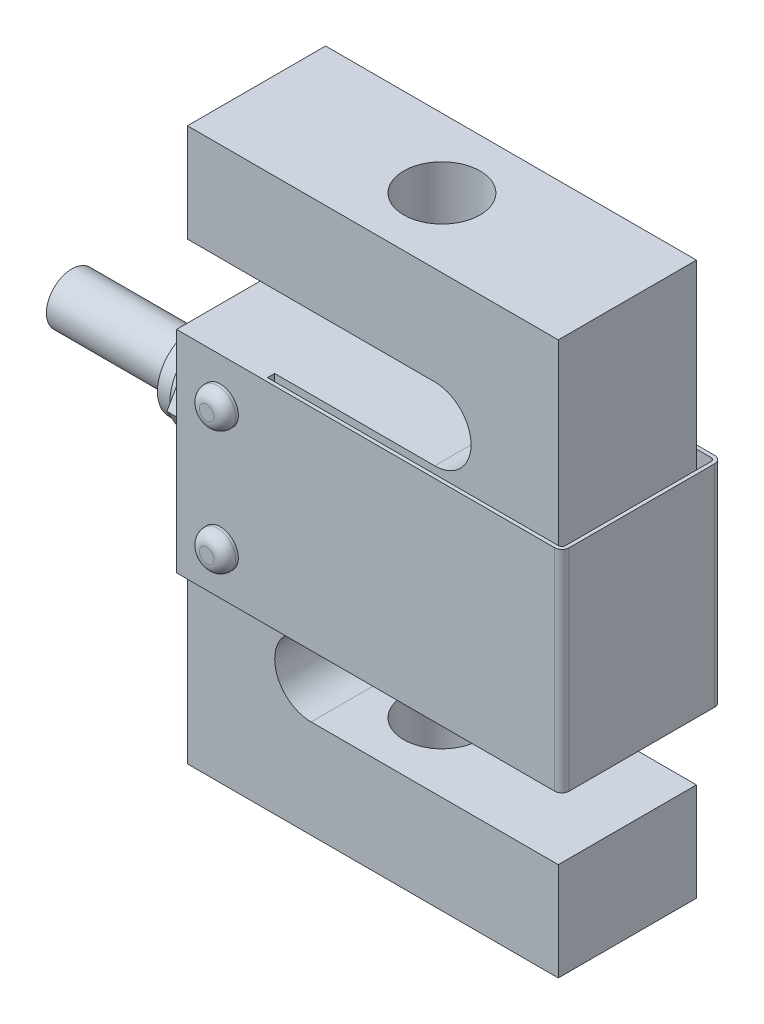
from build123d import *

# Parameters (mm, degrees)
EXTRUSION1_DEPTH           = 9.5
TROU_TARAUD_M12X1_51_D     = 10.5
TROU_TARAUD_M12X1_51_DEPTH = 13.5
TROU_TARAUD_M12X1_52_D     = 10.5
TROU_TARAUD_M12X1_52_DEPTH = 13.5
EXTRUSION2_DEPTH           = 29
ESQUISSE7_R                = 5.5
EXTRUSION3_DEPTH           = 1
EXTRUSION4_DEPTH           = 4.4
ESQUISSE9_R                = 5.5
EXTRUSION5_DEPTH           = 1
ESQUISSE10_R               = 5.225
EXTRUSION6_DEPTH           = 2
ESQUISSE11_R               = 3.5
EXTRUSION7_DEPTH           = 17
EXTRUSION8_DEPTH           = 1.86
EXTRUSION8_DEPTH_BACK      = 23.86
ESQUISSE12_R               = 2.5
CONG_1_R                   = 1.5


with BuildPart() as part:
    # Esquisse1 → Extrusion1 (new, symmetric)
    with BuildSketch(Plane.XY):
        with BuildLine():
            Line((-25.5, 0), (25.5, 0))
            Line((25.5, 0), (25.5, 13.5))
            Line((25.5, 13.5), (-8.5, 13.5))
            ThreePointArc((-8.5, 13.5), (-13.5, 18.5), (-8.5, 23.5))
            Line((-8.5, 23.5), (25.5, 23.5))
            Line((25.5, 23.5), (25.5, 76))
            Line((25.5, 76), (-25.5, 76))
            Line((-25.5, 76), (-25.5, 62.5))
            Line((-25.5, 62.5), (8.5, 62.5))
            ThreePointArc((8.5, 62.5), (13.5, 57.5), (8.5, 52.5))
            Line((8.5, 52.5), (-25.5, 52.5))
            Line((-25.5, 52.5), (-25.5, 0))
        make_face()
    extrude(amount=EXTRUSION1_DEPTH, both=True)

    # Trou taraud_ M12x1.51
    with Locations(Plane.XZ):
        with Locations((0, 0)):
            Hole(TROU_TARAUD_M12X1_51_D / 2, depth=TROU_TARAUD_M12X1_51_DEPTH)

    # Trou taraud_ M12x1.52
    with Locations(Plane(origin=(0, 76, 0), x_dir=(1, 0, 0), z_dir=(0, 1, 0))):
        with Locations((0, 0)):
            Hole(TROU_TARAUD_M12X1_52_D / 2, depth=TROU_TARAUD_M12X1_52_DEPTH)

    # Esquisse6 → Extrusion2 (add)
    with BuildSketch(Plane(origin=(0, 52.5, 0), x_dir=(-1, 0, 0), z_dir=(0, 1, 0))):
        with BuildLine():
            Line((25.5, 9.5), (25.5, 11))
            Line((25.5, 11), (-26.5, 11))
            ThreePointArc((-26.5, 11), (-27.207106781, 10.707106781), (-27.5, 10))
            Line((-27.5, 10), (-27.5, -10))
            ThreePointArc((-27.5, -10), (-27.207106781, -10.707106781), (-26.5, -11))
            Line((-26.5, -11), (25.5, -11))
            Line((25.5, -11), (25.5, -9.5))
            Line((25.5, -9.5), (13.5, -9.5))
            Line((13.5, -9.5), (13.5, -10.5))
            Line((13.5, -10.5), (-26.5, -10.5))
            ThreePointArc((-26.5, -10.5), (-26.853553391, -10.353553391), (-27, -10))
            Line((-27, -10), (-27, 10))
            ThreePointArc((-27, 10), (-26.853553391, 10.353553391), (-26.5, 10.5))
            Line((-26.5, 10.5), (13.5, 10.5))
            Line((13.5, 10.5), (13.5, 9.5))
            Line((13.5, 9.5), (25.5, 9.5))
        make_face()
    extrude(amount=-EXTRUSION2_DEPTH)

    # Esquisse7 → Extrusion3 (add)
    with BuildSketch(Plane.ZY.offset(25.5)):
        with Locations(Location((0, 38, 0), (0, 0, 90))):
            Circle(ESQUISSE7_R)
    extrude(amount=EXTRUSION3_DEPTH)

    # Esquisse8 → Extrusion4 (add)
    with BuildSketch(Plane.ZY.offset(26.5)):
        Polygon((3.464101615, 32), (6.92820323, 38), (3.464101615, 44), (-3.464101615, 44), (-6.92820323, 38), (-3.464101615, 32), align=None)
    extrude(amount=EXTRUSION4_DEPTH)

    # Esquisse9 → Extrusion5 (add)
    with BuildSketch(Plane.ZY.offset(30.9)):
        with Locations(Location((0, 38, 0), (0, 0, 90))):
            Circle(ESQUISSE9_R)
    extrude(amount=EXTRUSION5_DEPTH)

    # Esquisse10 → Extrusion6 (add)
    with BuildSketch(Plane.ZY.offset(31.9)):
        with Locations((0, 38)):
            Circle(ESQUISSE10_R)
    extrude(amount=EXTRUSION6_DEPTH)

    # Esquisse11 → Extrusion7 (add)
    with BuildSketch(Plane.ZY.offset(33.9)):
        with Locations((0, 38)):
            Circle(ESQUISSE11_R)
    extrude(amount=EXTRUSION7_DEPTH)

    # Esquisse12 → Extrusion8 (add, two sides: drawn at the far end of the back side and taken through both)
    with BuildSketch(Plane.XY.offset(11).offset(-EXTRUSION8_DEPTH_BACK)):
        with Locations((-19.5, 46.5)):
            Circle(ESQUISSE12_R)
        with Locations((-19.5, 29.5)):
            Circle(ESQUISSE12_R)
    extrude(amount=EXTRUSION8_DEPTH + EXTRUSION8_DEPTH_BACK)

    # Cong_1
    cong_1_edges = [part.edges().sort_by_distance(p)[0] for p in [
        (-22, 46.5, -12.86),
        (-22, 46.5, 12.86),
        (-22, 29.5, -12.86),
        (-22, 29.5, 12.86),
    ]]
    fillet(cong_1_edges, radius=CONG_1_R)


solid = part.part
